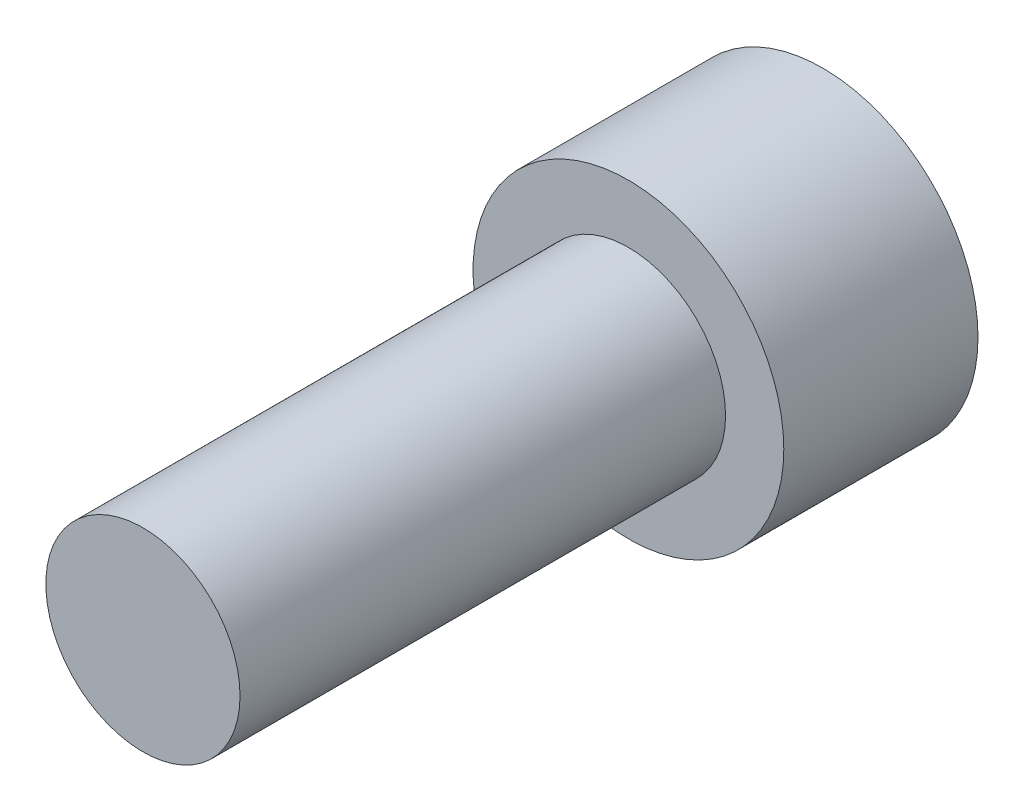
from build123d import *

# Parameters (mm, degrees)
HEX_2_DEPTH = 8


with BuildPart() as part:
    # Sketch6 → Revolve1 (revolve)
    with BuildSketch(Plane(origin=(0, 0, 0), x_dir=(0, 0, -1), z_dir=(1, 0, 0)), mode=Mode.PRIVATE) as revolve1_sk:
        Polygon((-25, 0), (-25, -5), (0, -5), (0, -8), (10, -8), (10, 0), align=None)
    revolve(revolve1_sk.sketch.rotate(Axis((0, 0, 25), (0, 0, -1)), 270), axis=Axis((0, 0, 25), (0, 0, -1)))

    # Sketch7 → HEX 2 (cut)
    with BuildSketch(Plane(origin=(0, 0, -10), x_dir=(-1, 0, 0), z_dir=(0, 0, -1))):
        Polygon((-4, 2.309401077), (-4, -2.309401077), (0, -4.618802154), (4, -2.309401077), (4, 2.309401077), (0, 4.618802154), align=None)
    extrude(amount=-HEX_2_DEPTH, mode=Mode.SUBTRACT)


solid = part.part
